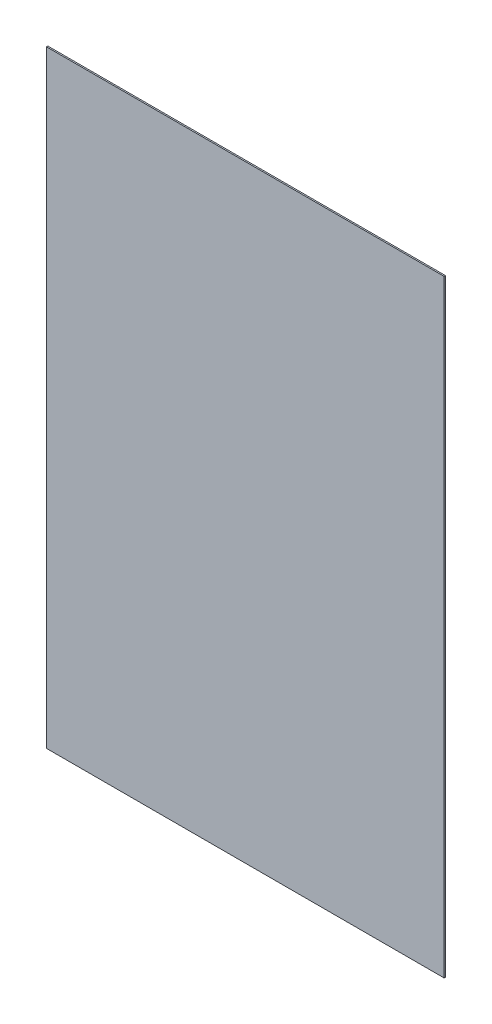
ISO-10303-21;
HEADER;
FILE_DESCRIPTION(('STEP AP214'),'2;1');
FILE_NAME('part.step','',(''),(''),'','','');
FILE_SCHEMA(('AUTOMOTIVE_DESIGN { 1 0 10303 214 1 1 1 1 }'));
ENDSEC;
DATA;
#1=APPLICATION_CONTEXT('core data for automotive mechanical design processes');
#2=APPLICATION_PROTOCOL_DEFINITION('international standard','automotive_design',2000,#1);
#3=PRODUCT_CONTEXT('',#1,'mechanical');
#4=PRODUCT('Part','Part','',(#3));
#5=PRODUCT_RELATED_PRODUCT_CATEGORY('part','',(#4));
#6=PRODUCT_DEFINITION_FORMATION('','',#4);
#7=PRODUCT_DEFINITION_CONTEXT('part definition',#1,'design');
#8=PRODUCT_DEFINITION('design','',#6,#7);
#9=PRODUCT_DEFINITION_SHAPE('','',#8);
#10=(LENGTH_UNIT() NAMED_UNIT(*) SI_UNIT(.MILLI.,.METRE.));
#11=(NAMED_UNIT(*) PLANE_ANGLE_UNIT() SI_UNIT($,.RADIAN.));
#12=(NAMED_UNIT(*) SI_UNIT($,.STERADIAN.) SOLID_ANGLE_UNIT());
#13=UNCERTAINTY_MEASURE_WITH_UNIT(LENGTH_MEASURE(1.E-05),#10,'distance_accuracy_value','');
#14=(GEOMETRIC_REPRESENTATION_CONTEXT(3) GLOBAL_UNCERTAINTY_ASSIGNED_CONTEXT((#13)) GLOBAL_UNIT_ASSIGNED_CONTEXT((#10,
#11,#12)) REPRESENTATION_CONTEXT('',''));
#15=CARTESIAN_POINT('',(0.,0.,0.));
#16=DIRECTION('',(0.,0.,1.));
#17=DIRECTION('',(1.,0.,0.));
#18=AXIS2_PLACEMENT_3D('',#15,#16,#17);
#19=CARTESIAN_POINT('',(457.2,-609.6,1.5875));
#20=DIRECTION('',(-1.,0.,0.));
#21=DIRECTION('',(0.,0.,1.));
#22=AXIS2_PLACEMENT_3D('',#19,#20,#21);
#23=PLANE('',#22);
#24=DIRECTION('',(0.,1.,0.));
#25=VECTOR('',#24,1.);
#26=CARTESIAN_POINT('',(457.2,-609.6,-1.5875));
#27=LINE('',#26,#25);
#28=CARTESIAN_POINT('',(457.2,-787.4,-1.5875));
#29=VERTEX_POINT('',#28);
#30=CARTESIAN_POINT('',(457.2,609.6,-1.5875));
#31=VERTEX_POINT('',#30);
#32=EDGE_CURVE('E70',#29,#31,#27,.T.);
#33=ORIENTED_EDGE('',*,*,#32,.T.);
#34=DIRECTION('',(0.,0.,-1.));
#35=VECTOR('',#34,1.);
#36=CARTESIAN_POINT('',(457.2,609.6,1.5875));
#37=LINE('',#36,#35);
#38=CARTESIAN_POINT('',(457.2,609.6,1.5875));
#39=VERTEX_POINT('',#38);
#40=EDGE_CURVE('E11',#39,#31,#37,.T.);
#41=ORIENTED_EDGE('',*,*,#40,.F.);
#42=DIRECTION('',(0.,1.,0.));
#43=VECTOR('',#42,1.);
#44=CARTESIAN_POINT('',(457.2,-609.6,1.5875));
#45=LINE('',#44,#43);
#46=CARTESIAN_POINT('',(457.2,-787.4,1.5875));
#47=VERTEX_POINT('',#46);
#48=EDGE_CURVE('E82',#47,#39,#45,.T.);
#49=ORIENTED_EDGE('',*,*,#48,.F.);
#50=DIRECTION('',(0.,0.,-1.));
#51=VECTOR('',#50,1.);
#52=CARTESIAN_POINT('',(457.2,-787.4,-1.5875));
#53=LINE('',#52,#51);
#54=EDGE_CURVE('E84',#47,#29,#53,.T.);
#55=ORIENTED_EDGE('',*,*,#54,.T.);
#56=EDGE_LOOP('',(#33,#41,#49,#55));
#57=FACE_BOUND('',#56,.T.);
#58=ADVANCED_FACE('F39',(#57),#23,.F.);
#59=CARTESIAN_POINT('',(-457.2,609.6,1.5875));
#60=DIRECTION('',(0.,-1.,0.));
#61=DIRECTION('',(0.,0.,-1.));
#62=AXIS2_PLACEMENT_3D('',#59,#60,#61);
#63=PLANE('',#62);
#64=DIRECTION('',(-1.,0.,0.));
#65=VECTOR('',#64,1.);
#66=CARTESIAN_POINT('',(-457.2,609.6,-1.5875));
#67=LINE('',#66,#65);
#68=CARTESIAN_POINT('',(-457.2,609.6,-1.5875));
#69=VERTEX_POINT('',#68);
#70=EDGE_CURVE('E66',#31,#69,#67,.T.);
#71=ORIENTED_EDGE('',*,*,#70,.T.);
#72=DIRECTION('',(0.,0.,-1.));
#73=VECTOR('',#72,1.);
#74=CARTESIAN_POINT('',(-457.2,609.6,1.5875));
#75=LINE('',#74,#73);
#76=CARTESIAN_POINT('',(-457.2,609.6,1.5875));
#77=VERTEX_POINT('',#76);
#78=EDGE_CURVE('E47',#77,#69,#75,.T.);
#79=ORIENTED_EDGE('',*,*,#78,.F.);
#80=DIRECTION('',(-1.,0.,0.));
#81=VECTOR('',#80,1.);
#82=CARTESIAN_POINT('',(-457.2,609.6,1.5875));
#83=LINE('',#82,#81);
#84=EDGE_CURVE('E55',#39,#77,#83,.T.);
#85=ORIENTED_EDGE('',*,*,#84,.F.);
#86=ORIENTED_EDGE('',*,*,#40,.T.);
#87=EDGE_LOOP('',(#71,#79,#85,#86));
#88=FACE_BOUND('',#87,.T.);
#89=ADVANCED_FACE('F123',(#88),#63,.F.);
#90=CARTESIAN_POINT('',(-457.2,-609.6,1.5875));
#91=DIRECTION('',(1.,0.,0.));
#92=DIRECTION('',(0.,0.,-1.));
#93=AXIS2_PLACEMENT_3D('',#90,#91,#92);
#94=PLANE('',#93);
#95=DIRECTION('',(0.,-1.,0.));
#96=VECTOR('',#95,1.);
#97=CARTESIAN_POINT('',(-457.2,-609.6,-1.5875));
#98=LINE('',#97,#96);
#99=CARTESIAN_POINT('',(-457.2,-787.4,-1.5875));
#100=VERTEX_POINT('',#99);
#101=EDGE_CURVE('E86',#69,#100,#98,.T.);
#102=ORIENTED_EDGE('',*,*,#101,.T.);
#103=DIRECTION('',(0.,0.,1.));
#104=VECTOR('',#103,1.);
#105=CARTESIAN_POINT('',(-457.2,-787.4,1.5875));
#106=LINE('',#105,#104);
#107=CARTESIAN_POINT('',(-457.2,-787.4,1.5875));
#108=VERTEX_POINT('',#107);
#109=EDGE_CURVE('E101',#100,#108,#106,.T.);
#110=ORIENTED_EDGE('',*,*,#109,.T.);
#111=DIRECTION('',(0.,-1.,0.));
#112=VECTOR('',#111,1.);
#113=CARTESIAN_POINT('',(-457.2,-609.6,1.5875));
#114=LINE('',#113,#112);
#115=EDGE_CURVE('E98',#77,#108,#114,.T.);
#116=ORIENTED_EDGE('',*,*,#115,.F.);
#117=ORIENTED_EDGE('',*,*,#78,.T.);
#118=EDGE_LOOP('',(#102,#110,#116,#117));
#119=FACE_BOUND('',#118,.T.);
#120=ADVANCED_FACE('F110',(#119),#94,.F.);
#121=CARTESIAN_POINT('',(0.,0.,1.5875));
#122=DIRECTION('',(0.,0.,-1.));
#123=DIRECTION('',(-1.,0.,0.));
#124=AXIS2_PLACEMENT_3D('',#121,#122,#123);
#125=PLANE('',#124);
#126=ORIENTED_EDGE('',*,*,#48,.T.);
#127=ORIENTED_EDGE('',*,*,#84,.T.);
#128=ORIENTED_EDGE('',*,*,#115,.T.);
#129=DIRECTION('',(1.,0.,0.));
#130=VECTOR('',#129,1.);
#131=CARTESIAN_POINT('',(457.2,-787.4,1.5875));
#132=LINE('',#131,#130);
#133=EDGE_CURVE('E92',#108,#47,#132,.T.);
#134=ORIENTED_EDGE('',*,*,#133,.T.);
#135=EDGE_LOOP('',(#126,#127,#128,#134));
#136=FACE_BOUND('',#135,.T.);
#137=ADVANCED_FACE('F96',(#136),#125,.F.);
#138=CARTESIAN_POINT('',(0.,0.,-1.5875));
#139=DIRECTION('',(0.,0.,-1.));
#140=DIRECTION('',(-1.,0.,0.));
#141=AXIS2_PLACEMENT_3D('',#138,#139,#140);
#142=PLANE('',#141);
#143=ORIENTED_EDGE('',*,*,#32,.F.);
#144=DIRECTION('',(-1.,0.,0.));
#145=VECTOR('',#144,1.);
#146=CARTESIAN_POINT('',(-457.2,-787.4,-1.5875));
#147=LINE('',#146,#145);
#148=EDGE_CURVE('E94',#29,#100,#147,.T.);
#149=ORIENTED_EDGE('',*,*,#148,.T.);
#150=ORIENTED_EDGE('',*,*,#101,.F.);
#151=ORIENTED_EDGE('',*,*,#70,.F.);
#152=EDGE_LOOP('',(#143,#149,#150,#151));
#153=FACE_BOUND('',#152,.T.);
#154=ADVANCED_FACE('F112',(#153),#142,.T.);
#155=CARTESIAN_POINT('',(-375.3739,-787.4,142.8115));
#156=DIRECTION('',(0.,1.,0.));
#157=DIRECTION('',(1.,0.,0.));
#158=AXIS2_PLACEMENT_3D('',#155,#156,#157);
#159=PLANE('',#158);
#160=ORIENTED_EDGE('',*,*,#148,.F.);
#161=ORIENTED_EDGE('',*,*,#54,.F.);
#162=ORIENTED_EDGE('',*,*,#133,.F.);
#163=ORIENTED_EDGE('',*,*,#109,.F.);
#164=EDGE_LOOP('',(#160,#161,#162,#163));
#165=FACE_BOUND('',#164,.T.);
#166=ADVANCED_FACE('F90',(#165),#159,.F.);
#167=CLOSED_SHELL('',(#58,#89,#120,#137,#154,#166));
#168=MANIFOLD_SOLID_BREP('B2',#167);
#169=ADVANCED_BREP_SHAPE_REPRESENTATION('',(#18,#168),#14);
#170=SHAPE_DEFINITION_REPRESENTATION(#9,#169);
ENDSEC;
END-ISO-10303-21;
